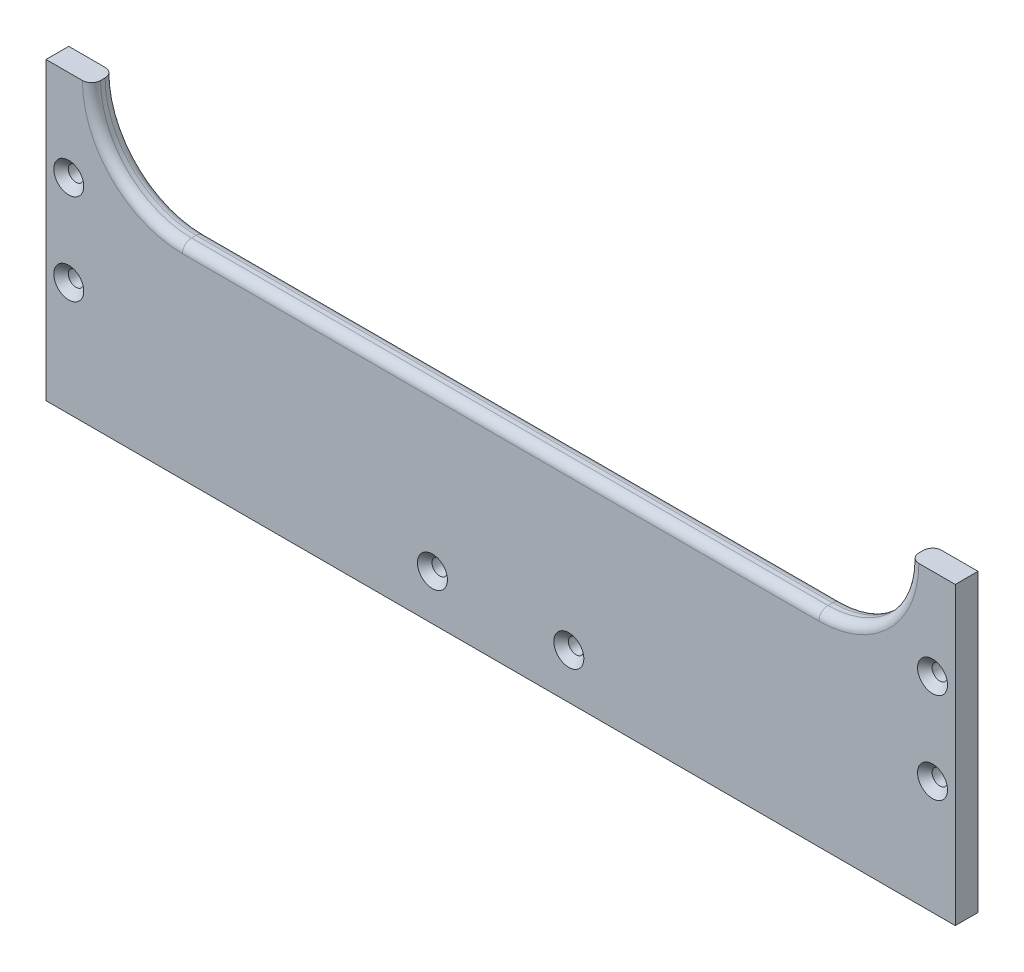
from build123d import *

# Parameters (mm, degrees)
SKETCH_1_W                   = 200
SKETCH_1_H                   = 80
EXTRUDE_1_DEPTH              = 5
HOLE_WIZARD_M3_1_D           = 3.4
HOLE_WIZARD_M3_1_DEPTH       = 14
HOLE_WIZARD_M3_1_CSINK_D     = 6.6
HOLE_WIZARD_M3_1_CSINK_ANGLE = 90
HOLE_WIZARD_M3_1_TIP         = 1.021463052
SKETCH_4_W                   = 200
SKETCH_4_H                   = 5
CUT_EXTRUDE_1_DEPTH          = 15
CUT_EXTRUDE_2_DEPTH          = 10
FILLET_1_R                   = 2
FILLET_2_R                   = 2


with BuildPart() as part:
    # Sketch 1 → Extrude 1 (new body)
    with BuildSketch(Plane.XY):
        Rectangle(SKETCH_1_W, SKETCH_1_H)
    extrude(amount=EXTRUDE_1_DEPTH)

    # Hole Wizard M3 _1
    with Locations(Plane.XY.offset(5)):
        with Locations((-15, -30), (15, -30), (-95, -15), (-95, 5), (95, 5), (95, -15)):
            CounterSinkHole(HOLE_WIZARD_M3_1_D / 2, HOLE_WIZARD_M3_1_CSINK_D / 2, depth=HOLE_WIZARD_M3_1_DEPTH, counter_sink_angle=HOLE_WIZARD_M3_1_CSINK_ANGLE)
            with Locations((0, 0, -(HOLE_WIZARD_M3_1_DEPTH + HOLE_WIZARD_M3_1_TIP / 2))):  # 118° drill point
                Cone(0, HOLE_WIZARD_M3_1_D / 2, HOLE_WIZARD_M3_1_TIP, mode=Mode.SUBTRACT)

    # Sketch 4 → Cut-Extrude 1 (cut)
    with BuildSketch(Plane(origin=(0, 40, 0), x_dir=(1, 0, 0), z_dir=(0, 1, 0))):
        with Locations((0, -2.5)):
            Rectangle(SKETCH_4_W, SKETCH_4_H)
    extrude(amount=-CUT_EXTRUDE_1_DEPTH, mode=Mode.SUBTRACT)

    # Sketch 5 → Cut-Extrude 2 (cut)
    with BuildSketch(Plane.XY.offset(5)):
        with BuildLine():
            Line((-70, 45), (70, 45))
            ThreePointArc((70, 45), (90, 25), (70, 5))
            Line((70, 5), (-70, 5))
            ThreePointArc((-70, 5), (-90, 25), (-70, 45))
        make_face()
    extrude(amount=-CUT_EXTRUDE_2_DEPTH, mode=Mode.SUBTRACT)

    # Fillet 1
    fillet_1_edges = [part.edges().sort_by_distance(p)[0] for p in [
        (-84.142135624, 10.857864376, 5),
        (0, 5, 5),
        (84.142135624, 10.857864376, 5),
    ]]
    fillet(fillet_1_edges, radius=FILLET_1_R)

    # Fillet 2
    fillet_2_edges = [part.edges().sort_by_distance(p)[0] for p in [
        (0, 5, 0),
        (-84.142135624, 10.857864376, 0),
        (84.142135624, 10.857864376, 0),
    ]]
    fillet(fillet_2_edges, radius=FILLET_2_R)


solid = part.part
